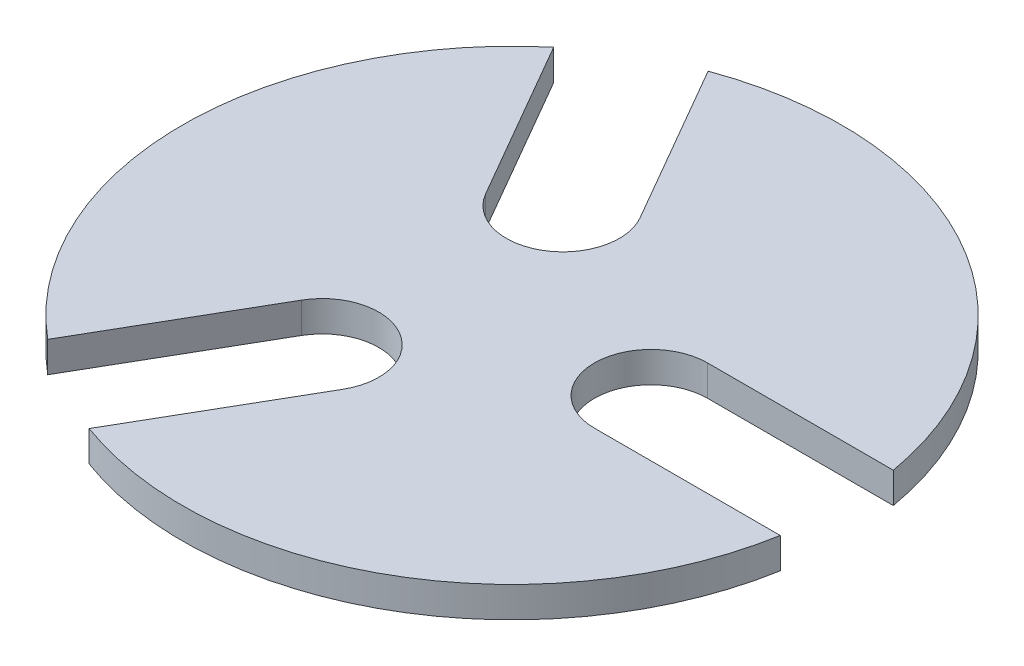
from build123d import *

# Parameters (mm, degrees)
SKETCH1_R          = 25.4
EXTRUDE1_DEPTH     = 1.1811
CUT_EXTRUDE1_DEPTH = 36.998610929
CIRPATTERN4_COUNT  = 3


with BuildPart() as part:
    # Sketch1 → Extrude1 (new, symmetric)
    with BuildSketch(Plane(origin=(0, 0, 0), x_dir=(1, 0, 0), z_dir=(0, 1, 0))):
        with Locations(Location((0, 0, 0), (0, 0, 270))):
            Circle(SKETCH1_R)
    extrude(amount=EXTRUDE1_DEPTH, both=True)

    # Sketch2 → Cut-Extrude1 (cut, through all)
    with BuildSketch(Plane(origin=(0, 1.1811, 0), x_dir=(-1, 0, 0), z_dir=(0, 1, 0))):
        with BuildLine():
            Line((-25.023676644, -4.3561), (-10.7061, -4.3561))
            ThreePointArc((-10.7061, -4.3561), (-6.35, 0), (-10.7061, 4.3561))
            Line((-10.7061, 4.3561), (-25.023676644, 4.3561))
            ThreePointArc((-25.023676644, 4.3561), (-25.4, 0), (-25.023676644, -4.3561))
        make_face()
    cut_extrude1 = extrude(amount=-CUT_EXTRUDE1_DEPTH, mode=Mode.SUBTRACT)

    # CirPattern4: Cut-Extrude1 ×3 about axis
    cirpattern4_axis = Axis((0, 1.1811, 0), (0, -1, 0))
    for i in range(1, CIRPATTERN4_COUNT):
        add(cut_extrude1.rotate(cirpattern4_axis, i * 360 / CIRPATTERN4_COUNT), mode=Mode.SUBTRACT)


solid = part.part
